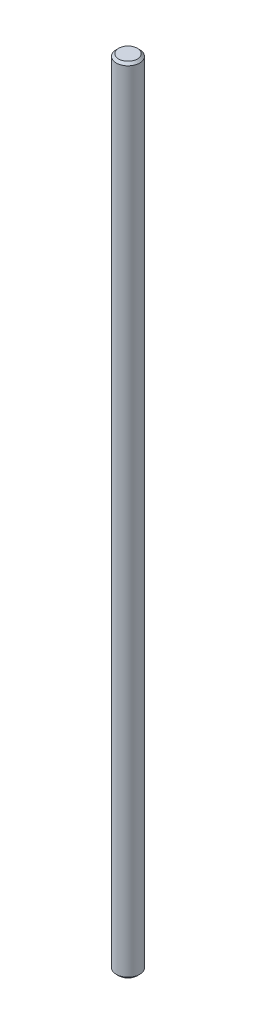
ISO-10303-21;
HEADER;
FILE_DESCRIPTION(('STEP AP214'),'2;1');
FILE_NAME('part.step','',(''),(''),'','','');
FILE_SCHEMA(('AUTOMOTIVE_DESIGN { 1 0 10303 214 1 1 1 1 }'));
ENDSEC;
DATA;
#1=APPLICATION_CONTEXT('core data for automotive mechanical design processes');
#2=APPLICATION_PROTOCOL_DEFINITION('international standard','automotive_design',2000,#1);
#3=PRODUCT_CONTEXT('',#1,'mechanical');
#4=PRODUCT('Part','Part','',(#3));
#5=PRODUCT_RELATED_PRODUCT_CATEGORY('part','',(#4));
#6=PRODUCT_DEFINITION_FORMATION('','',#4);
#7=PRODUCT_DEFINITION_CONTEXT('part definition',#1,'design');
#8=PRODUCT_DEFINITION('design','',#6,#7);
#9=PRODUCT_DEFINITION_SHAPE('','',#8);
#10=(LENGTH_UNIT() NAMED_UNIT(*) SI_UNIT(.MILLI.,.METRE.));
#11=(NAMED_UNIT(*) PLANE_ANGLE_UNIT() SI_UNIT($,.RADIAN.));
#12=(NAMED_UNIT(*) SI_UNIT($,.STERADIAN.) SOLID_ANGLE_UNIT());
#13=UNCERTAINTY_MEASURE_WITH_UNIT(LENGTH_MEASURE(1.E-05),#10,'distance_accuracy_value','');
#14=(GEOMETRIC_REPRESENTATION_CONTEXT(3) GLOBAL_UNCERTAINTY_ASSIGNED_CONTEXT((#13)) GLOBAL_UNIT_ASSIGNED_CONTEXT((#10,
#11,#12)) REPRESENTATION_CONTEXT('',''));
#15=CARTESIAN_POINT('',(0.,0.,0.));
#16=DIRECTION('',(0.,0.,1.));
#17=DIRECTION('',(1.,0.,0.));
#18=AXIS2_PLACEMENT_3D('',#15,#16,#17);
#19=CARTESIAN_POINT('',(0.,136.,0.));
#20=DIRECTION('',(0.,-1.,0.));
#21=DIRECTION('',(0.,0.,-1.));
#22=AXIS2_PLACEMENT_3D('',#19,#20,#21);
#23=CYLINDRICAL_SURFACE('',#22,2.);
#24=CARTESIAN_POINT('',(0.,0.399999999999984,0.));
#25=DIRECTION('',(0.,1.,0.));
#26=DIRECTION('',(0.,0.,1.));
#27=AXIS2_PLACEMENT_3D('',#24,#25,#26);
#28=CIRCLE('',#27,2.);
#29=CARTESIAN_POINT('',(0.,0.399999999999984,2.));
#30=VERTEX_POINT('',#29);
#31=EDGE_CURVE('E39',#30,#30,#28,.T.);
#32=ORIENTED_EDGE('',*,*,#31,.T.);
#33=EDGE_LOOP('',(#32));
#34=FACE_BOUND('',#33,.T.);
#35=CARTESIAN_POINT('',(0.,135.6,0.));
#36=DIRECTION('',(0.,1.,0.));
#37=DIRECTION('',(0.,0.,1.));
#38=AXIS2_PLACEMENT_3D('',#35,#36,#37);
#39=CIRCLE('',#38,2.);
#40=CARTESIAN_POINT('',(0.,135.6,2.));
#41=VERTEX_POINT('',#40);
#42=EDGE_CURVE('E43',#41,#41,#39,.F.);
#43=ORIENTED_EDGE('',*,*,#42,.T.);
#44=EDGE_LOOP('',(#43));
#45=FACE_BOUND('',#44,.T.);
#46=ADVANCED_FACE('F28',(#34,#45),#23,.T.);
#47=CARTESIAN_POINT('',(0.,136.,0.));
#48=DIRECTION('',(0.,1.,0.));
#49=DIRECTION('',(0.,0.,1.));
#50=AXIS2_PLACEMENT_3D('',#47,#48,#49);
#51=PLANE('',#50);
#52=CARTESIAN_POINT('',(0.,136.,0.));
#53=DIRECTION('',(0.,1.,0.));
#54=DIRECTION('',(0.,0.,1.));
#55=AXIS2_PLACEMENT_3D('',#52,#53,#54);
#56=CIRCLE('',#55,1.59999999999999);
#57=CARTESIAN_POINT('',(0.,136.,1.59999999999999));
#58=VERTEX_POINT('',#57);
#59=EDGE_CURVE('E10',#58,#58,#56,.T.);
#60=ORIENTED_EDGE('',*,*,#59,.T.);
#61=EDGE_LOOP('',(#60));
#62=FACE_BOUND('',#61,.T.);
#63=ADVANCED_FACE('F59',(#62),#51,.T.);
#64=CARTESIAN_POINT('',(0.,0.,0.));
#65=DIRECTION('',(0.,1.,0.));
#66=DIRECTION('',(0.,0.,1.));
#67=AXIS2_PLACEMENT_3D('',#64,#65,#66);
#68=PLANE('',#67);
#69=CARTESIAN_POINT('',(0.,0.,0.));
#70=DIRECTION('',(0.,1.,0.));
#71=DIRECTION('',(0.,0.,1.));
#72=AXIS2_PLACEMENT_3D('',#69,#70,#71);
#73=CIRCLE('',#72,1.6);
#74=CARTESIAN_POINT('',(0.,0.,1.6));
#75=VERTEX_POINT('',#74);
#76=EDGE_CURVE('E35',#75,#75,#73,.F.);
#77=ORIENTED_EDGE('',*,*,#76,.T.);
#78=EDGE_LOOP('',(#77));
#79=FACE_BOUND('',#78,.T.);
#80=ADVANCED_FACE('F56',(#79),#68,.F.);
#81=CARTESIAN_POINT('',(0.,0.399999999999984,0.));
#82=DIRECTION('',(0.,1.,0.));
#83=DIRECTION('',(0.,0.,1.));
#84=AXIS2_PLACEMENT_3D('',#81,#82,#83);
#85=CONICAL_SURFACE('',#84,2.,0.785398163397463);
#86=ORIENTED_EDGE('',*,*,#76,.F.);
#87=EDGE_LOOP('',(#86));
#88=FACE_BOUND('',#87,.T.);
#89=ORIENTED_EDGE('',*,*,#31,.F.);
#90=EDGE_LOOP('',(#89));
#91=FACE_BOUND('',#90,.T.);
#92=ADVANCED_FACE('F52',(#88,#91),#85,.T.);
#93=CARTESIAN_POINT('',(0.,136.,0.));
#94=DIRECTION('',(0.,-1.,0.));
#95=DIRECTION('',(0.,0.,-1.));
#96=AXIS2_PLACEMENT_3D('',#93,#94,#95);
#97=CONICAL_SURFACE('',#96,1.59999999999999,0.785398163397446);
#98=ORIENTED_EDGE('',*,*,#42,.F.);
#99=EDGE_LOOP('',(#98));
#100=FACE_BOUND('',#99,.T.);
#101=ORIENTED_EDGE('',*,*,#59,.F.);
#102=EDGE_LOOP('',(#101));
#103=FACE_BOUND('',#102,.T.);
#104=ADVANCED_FACE('F30',(#100,#103),#97,.T.);
#105=CLOSED_SHELL('',(#46,#63,#80,#92,#104));
#106=MANIFOLD_SOLID_BREP('B2',#105);
#107=ADVANCED_BREP_SHAPE_REPRESENTATION('',(#18,#106),#14);
#108=SHAPE_DEFINITION_REPRESENTATION(#9,#107);
ENDSEC;
END-ISO-10303-21;
